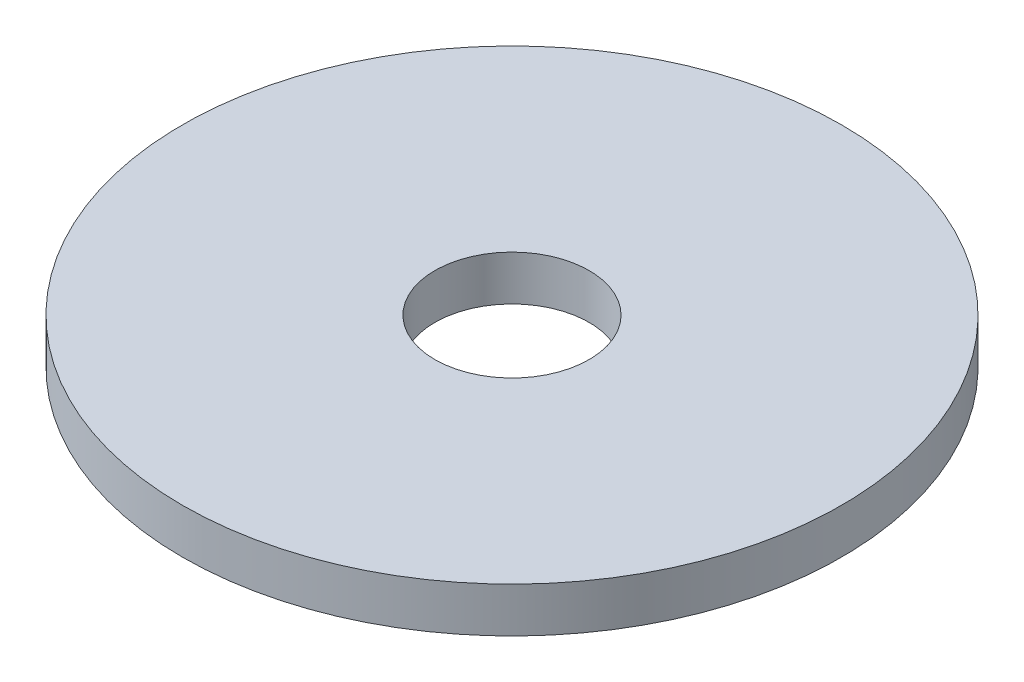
from build123d import *

# Parameters (mm, degrees)
ESQUISSE1_W = 16.85
ESQUISSE1_H = 3


with BuildPart() as part:
    # Esquisse1 → R_volution1 (revolve)
    with BuildSketch(Plane(origin=(0, 0, 0), x_dir=(-1, 0, 0), z_dir=(0, 0, -1)), mode=Mode.PRIVATE) as r_volution1_sk:
        with Locations((-13.575, 1.5)):
            Rectangle(ESQUISSE1_W, ESQUISSE1_H)
    revolve(r_volution1_sk.sketch.rotate(Axis((0, 0, 0), (0, 1, 0)), 270), axis=Axis((0, 0, 0), (0, 1, 0)))


solid = part.part
